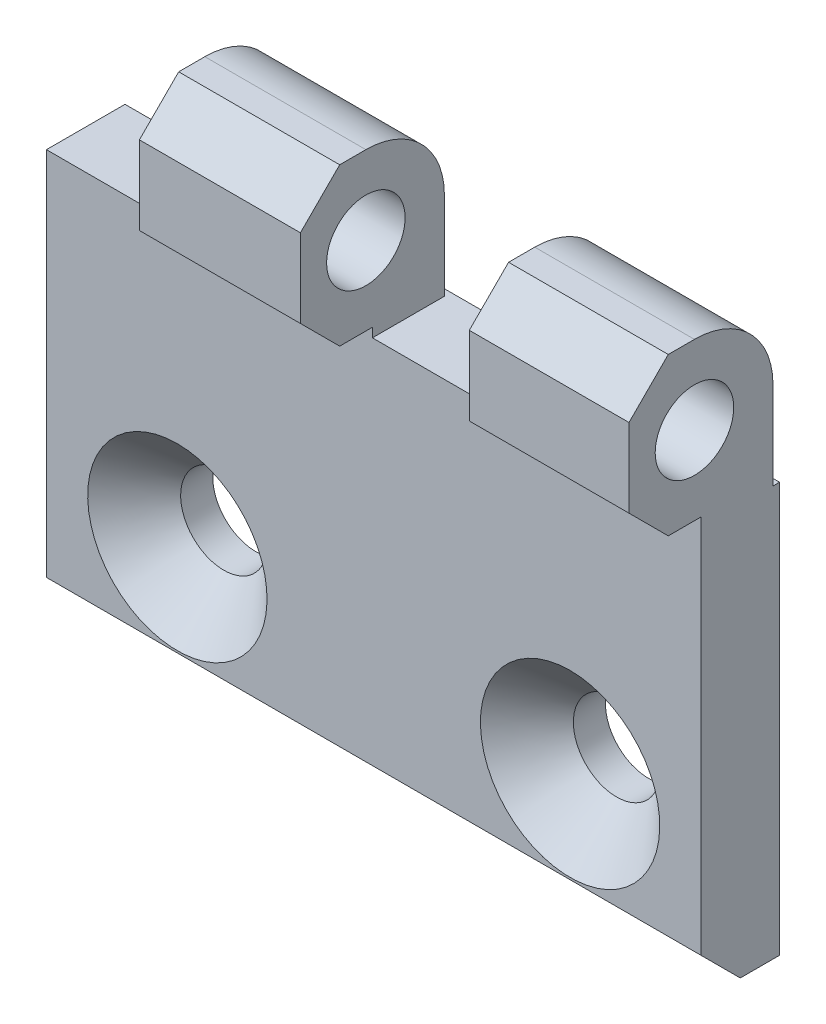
ISO-10303-21;
HEADER;
FILE_DESCRIPTION(('STEP AP214'),'2;1');
FILE_NAME('part.step','',(''),(''),'','','');
FILE_SCHEMA(('AUTOMOTIVE_DESIGN { 1 0 10303 214 1 1 1 1 }'));
ENDSEC;
DATA;
#1=APPLICATION_CONTEXT('core data for automotive mechanical design processes');
#2=APPLICATION_PROTOCOL_DEFINITION('international standard','automotive_design',2000,#1);
#3=PRODUCT_CONTEXT('',#1,'mechanical');
#4=PRODUCT('Part','Part','',(#3));
#5=PRODUCT_RELATED_PRODUCT_CATEGORY('part','',(#4));
#6=PRODUCT_DEFINITION_FORMATION('','',#4);
#7=PRODUCT_DEFINITION_CONTEXT('part definition',#1,'design');
#8=PRODUCT_DEFINITION('design','',#6,#7);
#9=PRODUCT_DEFINITION_SHAPE('','',#8);
#10=(LENGTH_UNIT() NAMED_UNIT(*) SI_UNIT(.MILLI.,.METRE.));
#11=(NAMED_UNIT(*) PLANE_ANGLE_UNIT() SI_UNIT($,.RADIAN.));
#12=(NAMED_UNIT(*) SI_UNIT($,.STERADIAN.) SOLID_ANGLE_UNIT());
#13=UNCERTAINTY_MEASURE_WITH_UNIT(LENGTH_MEASURE(1.E-05),#10,'distance_accuracy_value','');
#14=(GEOMETRIC_REPRESENTATION_CONTEXT(3) GLOBAL_UNCERTAINTY_ASSIGNED_CONTEXT((#13)) GLOBAL_UNIT_ASSIGNED_CONTEXT((#10,
#11,#12)) REPRESENTATION_CONTEXT('',''));
#15=CARTESIAN_POINT('',(0.,0.,0.));
#16=DIRECTION('',(0.,0.,1.));
#17=DIRECTION('',(1.,0.,0.));
#18=AXIS2_PLACEMENT_3D('',#15,#16,#17);
#19=CARTESIAN_POINT('',(40.,21.3,3.));
#20=DIRECTION('',(0.,0.,-1.));
#21=DIRECTION('',(1.,0.,0.));
#22=AXIS2_PLACEMENT_3D('',#19,#20,#21);
#23=PLANE('',#22);
#24=DIRECTION('',(-1.,0.,0.));
#25=VECTOR('',#24,1.);
#26=CARTESIAN_POINT('',(-4.818,18.,3.));
#27=LINE('',#26,#25);
#28=CARTESIAN_POINT('',(-4.818,18.,3.));
#29=VERTEX_POINT('',#28);
#30=CARTESIAN_POINT('',(35.182,18.,3.));
#31=VERTEX_POINT('',#30);
#32=EDGE_CURVE('E301',#29,#31,#27,.F.);
#33=ORIENTED_EDGE('',*,*,#32,.T.);
#34=DIRECTION('',(0.,1.,0.));
#35=VECTOR('',#34,1.);
#36=CARTESIAN_POINT('',(35.182,18.,3.));
#37=LINE('',#36,#35);
#38=CARTESIAN_POINT('',(35.182,7.,3.));
#39=VERTEX_POINT('',#38);
#40=EDGE_CURVE('E261',#31,#39,#37,.F.);
#41=ORIENTED_EDGE('',*,*,#40,.T.);
#42=DIRECTION('',(1.,0.,0.));
#43=VECTOR('',#42,1.);
#44=CARTESIAN_POINT('',(35.182,7.,3.));
#45=LINE('',#44,#43);
#46=CARTESIAN_POINT('',(30.,7.,3.));
#47=VERTEX_POINT('',#46);
#48=EDGE_CURVE('E293',#39,#47,#45,.F.);
#49=ORIENTED_EDGE('',*,*,#48,.T.);
#50=CARTESIAN_POINT('',(30.,0.,3.));
#51=DIRECTION('',(0.,0.,-1.));
#52=DIRECTION('',(1.,0.,0.));
#53=AXIS2_PLACEMENT_3D('',#50,#51,#52);
#54=CIRCLE('',#53,7.);
#55=CARTESIAN_POINT('',(25.1010205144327,-4.9999999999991,3.));
#56=VERTEX_POINT('',#55);
#57=EDGE_CURVE('E216',#56,#47,#54,.T.);
#58=ORIENTED_EDGE('',*,*,#57,.F.);
#59=DIRECTION('',(1.,0.,0.));
#60=VECTOR('',#59,1.);
#61=CARTESIAN_POINT('',(25.10102051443,-5.,3.));
#62=LINE('',#61,#60);
#63=CARTESIAN_POINT('',(4.89897948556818,-5.,3.));
#64=VERTEX_POINT('',#63);
#65=EDGE_CURVE('E212',#56,#64,#62,.F.);
#66=ORIENTED_EDGE('',*,*,#65,.T.);
#67=CARTESIAN_POINT('',(0.,0.,3.));
#68=DIRECTION('',(0.,0.,-1.));
#69=DIRECTION('',(1.,0.,0.));
#70=AXIS2_PLACEMENT_3D('',#67,#68,#69);
#71=CIRCLE('',#70,7.);
#72=CARTESIAN_POINT('',(0.,7.,3.));
#73=VERTEX_POINT('',#72);
#74=EDGE_CURVE('E17',#73,#64,#71,.T.);
#75=ORIENTED_EDGE('',*,*,#74,.F.);
#76=DIRECTION('',(1.,0.,0.));
#77=VECTOR('',#76,1.);
#78=CARTESIAN_POINT('',(0.,7.,3.));
#79=LINE('',#78,#77);
#80=CARTESIAN_POINT('',(-4.818,7.,3.));
#81=VERTEX_POINT('',#80);
#82=EDGE_CURVE('E207',#73,#81,#79,.F.);
#83=ORIENTED_EDGE('',*,*,#82,.T.);
#84=DIRECTION('',(0.,-1.,0.));
#85=VECTOR('',#84,1.);
#86=CARTESIAN_POINT('',(-4.818,7.,3.));
#87=LINE('',#86,#85);
#88=EDGE_CURVE('E250',#81,#29,#87,.F.);
#89=ORIENTED_EDGE('',*,*,#88,.T.);
#90=EDGE_LOOP('',(#33,#41,#49,#58,#66,#75,#83,#89));
#91=FACE_BOUND('',#90,.T.);
#92=ADVANCED_FACE('F14',(#91),#23,.T.);
#93=CARTESIAN_POINT('',(-4.818,18.,0.));
#94=DIRECTION('',(0.,1.,0.));
#95=DIRECTION('',(-1.,0.,0.));
#96=AXIS2_PLACEMENT_3D('',#93,#94,#95);
#97=PLANE('',#96);
#98=ORIENTED_EDGE('',*,*,#32,.F.);
#99=DIRECTION('',(0.,0.,1.));
#100=VECTOR('',#99,1.);
#101=CARTESIAN_POINT('',(-4.818,18.,0.));
#102=LINE('',#101,#100);
#103=CARTESIAN_POINT('',(-4.818,18.,0.));
#104=VERTEX_POINT('',#103);
#105=EDGE_CURVE('E248',#29,#104,#102,.F.);
#106=ORIENTED_EDGE('',*,*,#105,.T.);
#107=DIRECTION('',(1.,0.,0.));
#108=VECTOR('',#107,1.);
#109=CARTESIAN_POINT('',(40.,18.,0.));
#110=LINE('',#109,#108);
#111=CARTESIAN_POINT('',(35.182,18.,0.));
#112=VERTEX_POINT('',#111);
#113=EDGE_CURVE('E245',#112,#104,#110,.F.);
#114=ORIENTED_EDGE('',*,*,#113,.F.);
#115=DIRECTION('',(0.,0.,1.));
#116=VECTOR('',#115,1.);
#117=CARTESIAN_POINT('',(35.182,18.,0.));
#118=LINE('',#117,#116);
#119=EDGE_CURVE('E258',#112,#31,#118,.T.);
#120=ORIENTED_EDGE('',*,*,#119,.T.);
#121=EDGE_LOOP('',(#98,#106,#114,#120));
#122=FACE_BOUND('',#121,.T.);
#123=ADVANCED_FACE('F774',(#122),#97,.F.);
#124=CARTESIAN_POINT('',(-4.818,7.,0.));
#125=DIRECTION('',(-1.,0.,0.));
#126=DIRECTION('',(0.,-1.,0.));
#127=AXIS2_PLACEMENT_3D('',#124,#125,#126);
#128=PLANE('',#127);
#129=ORIENTED_EDGE('',*,*,#88,.F.);
#130=DIRECTION('',(0.,0.,1.));
#131=VECTOR('',#130,1.);
#132=CARTESIAN_POINT('',(-4.818,7.,0.));
#133=LINE('',#132,#131);
#134=CARTESIAN_POINT('',(-4.818,7.,0.));
#135=VERTEX_POINT('',#134);
#136=EDGE_CURVE('E237',#81,#135,#133,.F.);
#137=ORIENTED_EDGE('',*,*,#136,.T.);
#138=DIRECTION('',(0.,-1.,0.));
#139=VECTOR('',#138,1.);
#140=CARTESIAN_POINT('',(-4.818,21.3,0.));
#141=LINE('',#140,#139);
#142=EDGE_CURVE('E241',#104,#135,#141,.T.);
#143=ORIENTED_EDGE('',*,*,#142,.F.);
#144=ORIENTED_EDGE('',*,*,#105,.F.);
#145=EDGE_LOOP('',(#129,#137,#143,#144));
#146=FACE_BOUND('',#145,.T.);
#147=ADVANCED_FACE('F772',(#146),#128,.F.);
#148=CARTESIAN_POINT('',(0.,7.,0.));
#149=DIRECTION('',(0.,-1.,0.));
#150=DIRECTION('',(1.,0.,0.));
#151=AXIS2_PLACEMENT_3D('',#148,#149,#150);
#152=PLANE('',#151);
#153=ORIENTED_EDGE('',*,*,#82,.F.);
#154=DIRECTION('',(0.,0.,-1.));
#155=VECTOR('',#154,1.);
#156=CARTESIAN_POINT('',(0.,7.,0.));
#157=LINE('',#156,#155);
#158=CARTESIAN_POINT('',(0.,7.,0.));
#159=VERTEX_POINT('',#158);
#160=EDGE_CURVE('E226',#159,#73,#157,.F.);
#161=ORIENTED_EDGE('',*,*,#160,.F.);
#162=DIRECTION('',(1.,0.,0.));
#163=VECTOR('',#162,1.);
#164=CARTESIAN_POINT('',(40.,7.,0.));
#165=LINE('',#164,#163);
#166=EDGE_CURVE('E244',#135,#159,#165,.T.);
#167=ORIENTED_EDGE('',*,*,#166,.F.);
#168=ORIENTED_EDGE('',*,*,#136,.F.);
#169=EDGE_LOOP('',(#153,#161,#167,#168));
#170=FACE_BOUND('',#169,.T.);
#171=ADVANCED_FACE('F769',(#170),#152,.F.);
#172=CARTESIAN_POINT('',(0.,0.,0.));
#173=DIRECTION('',(0.,0.,-1.));
#174=DIRECTION('',(1.,0.,0.));
#175=AXIS2_PLACEMENT_3D('',#172,#173,#174);
#176=CYLINDRICAL_SURFACE('',#175,7.);
#177=DIRECTION('',(0.,0.,1.));
#178=VECTOR('',#177,1.);
#179=CARTESIAN_POINT('',(4.89897948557,-5.,0.));
#180=LINE('',#179,#178);
#181=CARTESIAN_POINT('',(4.89897948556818,-5.,0.));
#182=VERTEX_POINT('',#181);
#183=EDGE_CURVE('E220',#64,#182,#180,.F.);
#184=ORIENTED_EDGE('',*,*,#183,.T.);
#185=CARTESIAN_POINT('',(0.,0.,0.));
#186=DIRECTION('',(0.,0.,-1.));
#187=DIRECTION('',(1.,0.,0.));
#188=AXIS2_PLACEMENT_3D('',#185,#186,#187);
#189=CIRCLE('',#188,7.);
#190=EDGE_CURVE('E338',#159,#182,#189,.T.);
#191=ORIENTED_EDGE('',*,*,#190,.F.);
#192=ORIENTED_EDGE('',*,*,#160,.T.);
#193=ORIENTED_EDGE('',*,*,#74,.T.);
#194=EDGE_LOOP('',(#184,#191,#192,#193));
#195=FACE_BOUND('',#194,.T.);
#196=ADVANCED_FACE('F223',(#195),#176,.T.);
#197=CARTESIAN_POINT('',(25.10102051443,-5.,0.));
#198=DIRECTION('',(0.,-1.,0.));
#199=DIRECTION('',(1.,0.,0.));
#200=AXIS2_PLACEMENT_3D('',#197,#198,#199);
#201=PLANE('',#200);
#202=ORIENTED_EDGE('',*,*,#65,.F.);
#203=DIRECTION('',(0.,0.,-1.));
#204=VECTOR('',#203,1.);
#205=CARTESIAN_POINT('',(25.1010205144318,-4.99999999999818,0.));
#206=LINE('',#205,#204);
#207=CARTESIAN_POINT('',(25.1010205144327,-4.9999999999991,0.));
#208=VERTEX_POINT('',#207);
#209=EDGE_CURVE('E231',#208,#56,#206,.F.);
#210=ORIENTED_EDGE('',*,*,#209,.F.);
#211=DIRECTION('',(1.,0.,0.));
#212=VECTOR('',#211,1.);
#213=CARTESIAN_POINT('',(40.,-5.,0.));
#214=LINE('',#213,#212);
#215=EDGE_CURVE('E229',#182,#208,#214,.T.);
#216=ORIENTED_EDGE('',*,*,#215,.F.);
#217=ORIENTED_EDGE('',*,*,#183,.F.);
#218=EDGE_LOOP('',(#202,#210,#216,#217));
#219=FACE_BOUND('',#218,.T.);
#220=ADVANCED_FACE('F227',(#219),#201,.F.);
#221=CARTESIAN_POINT('',(30.,0.,0.));
#222=DIRECTION('',(0.,0.,-1.));
#223=DIRECTION('',(1.,0.,0.));
#224=AXIS2_PLACEMENT_3D('',#221,#222,#223);
#225=CYLINDRICAL_SURFACE('',#224,7.);
#226=DIRECTION('',(0.,0.,1.));
#227=VECTOR('',#226,1.);
#228=CARTESIAN_POINT('',(30.,7.,0.));
#229=LINE('',#228,#227);
#230=CARTESIAN_POINT('',(30.,7.,0.));
#231=VERTEX_POINT('',#230);
#232=EDGE_CURVE('E262',#47,#231,#229,.F.);
#233=ORIENTED_EDGE('',*,*,#232,.T.);
#234=CARTESIAN_POINT('',(30.,0.,0.));
#235=DIRECTION('',(0.,0.,-1.));
#236=DIRECTION('',(1.,0.,0.));
#237=AXIS2_PLACEMENT_3D('',#234,#235,#236);
#238=CIRCLE('',#237,7.);
#239=EDGE_CURVE('E334',#208,#231,#238,.T.);
#240=ORIENTED_EDGE('',*,*,#239,.F.);
#241=ORIENTED_EDGE('',*,*,#209,.T.);
#242=ORIENTED_EDGE('',*,*,#57,.T.);
#243=EDGE_LOOP('',(#233,#240,#241,#242));
#244=FACE_BOUND('',#243,.T.);
#245=ADVANCED_FACE('F345',(#244),#225,.T.);
#246=CARTESIAN_POINT('',(35.182,7.,0.));
#247=DIRECTION('',(0.,-1.,0.));
#248=DIRECTION('',(1.,0.,0.));
#249=AXIS2_PLACEMENT_3D('',#246,#247,#248);
#250=PLANE('',#249);
#251=ORIENTED_EDGE('',*,*,#48,.F.);
#252=DIRECTION('',(0.,0.,1.));
#253=VECTOR('',#252,1.);
#254=CARTESIAN_POINT('',(35.182,7.,0.));
#255=LINE('',#254,#253);
#256=CARTESIAN_POINT('',(35.182,7.,0.));
#257=VERTEX_POINT('',#256);
#258=EDGE_CURVE('E298',#39,#257,#255,.F.);
#259=ORIENTED_EDGE('',*,*,#258,.T.);
#260=DIRECTION('',(1.,0.,0.));
#261=VECTOR('',#260,1.);
#262=CARTESIAN_POINT('',(40.,7.,0.));
#263=LINE('',#262,#261);
#264=EDGE_CURVE('E337',#231,#257,#263,.T.);
#265=ORIENTED_EDGE('',*,*,#264,.F.);
#266=ORIENTED_EDGE('',*,*,#232,.F.);
#267=EDGE_LOOP('',(#251,#259,#265,#266));
#268=FACE_BOUND('',#267,.T.);
#269=ADVANCED_FACE('F350',(#268),#250,.F.);
#270=CARTESIAN_POINT('',(35.182,18.,0.));
#271=DIRECTION('',(1.,0.,0.));
#272=DIRECTION('',(0.,1.,0.));
#273=AXIS2_PLACEMENT_3D('',#270,#271,#272);
#274=PLANE('',#273);
#275=ORIENTED_EDGE('',*,*,#40,.F.);
#276=ORIENTED_EDGE('',*,*,#119,.F.);
#277=DIRECTION('',(0.,-1.,0.));
#278=VECTOR('',#277,1.);
#279=CARTESIAN_POINT('',(35.182,21.3,0.));
#280=LINE('',#279,#278);
#281=EDGE_CURVE('E358',#257,#112,#280,.F.);
#282=ORIENTED_EDGE('',*,*,#281,.F.);
#283=ORIENTED_EDGE('',*,*,#258,.F.);
#284=EDGE_LOOP('',(#275,#276,#282,#283));
#285=FACE_BOUND('',#284,.T.);
#286=ADVANCED_FACE('F757',(#285),#274,.F.);
#287=CARTESIAN_POINT('',(14.9,22.,11.5));
#288=DIRECTION('',(0.,0.,1.));
#289=DIRECTION('',(-1.,0.,0.));
#290=AXIS2_PLACEMENT_3D('',#287,#288,#289);
#291=PLANE('',#290);
#292=DIRECTION('',(-1.,0.,0.));
#293=VECTOR('',#292,1.);
#294=CARTESIAN_POINT('',(14.9,25.,11.5));
#295=LINE('',#294,#293);
#296=CARTESIAN_POINT('',(14.9,25.,11.5));
#297=VERTEX_POINT('',#296);
#298=CARTESIAN_POINT('',(2.6,25.,11.5));
#299=VERTEX_POINT('',#298);
#300=EDGE_CURVE('E342',#297,#299,#295,.T.);
#301=ORIENTED_EDGE('',*,*,#300,.F.);
#302=DIRECTION('',(0.,-1.,0.));
#303=VECTOR('',#302,1.);
#304=CARTESIAN_POINT('',(14.9,5.65,11.5));
#305=LINE('',#304,#303);
#306=CARTESIAN_POINT('',(14.9,31.,11.5));
#307=VERTEX_POINT('',#306);
#308=EDGE_CURVE('E381',#297,#307,#305,.F.);
#309=ORIENTED_EDGE('',*,*,#308,.T.);
#310=DIRECTION('',(-1.,0.,0.));
#311=VECTOR('',#310,1.);
#312=CARTESIAN_POINT('',(14.9,31.,11.5));
#313=LINE('',#312,#311);
#314=CARTESIAN_POINT('',(2.6,31.,11.5));
#315=VERTEX_POINT('',#314);
#316=EDGE_CURVE('E363',#315,#307,#313,.F.);
#317=ORIENTED_EDGE('',*,*,#316,.F.);
#318=DIRECTION('',(0.,-1.,0.));
#319=VECTOR('',#318,1.);
#320=CARTESIAN_POINT('',(2.6,5.65,11.5));
#321=LINE('',#320,#319);
#322=EDGE_CURVE('E422',#299,#315,#321,.F.);
#323=ORIENTED_EDGE('',*,*,#322,.F.);
#324=EDGE_LOOP('',(#301,#309,#317,#323));
#325=FACE_BOUND('',#324,.T.);
#326=ADVANCED_FACE('F612',(#325),#291,.T.);
#327=CARTESIAN_POINT('',(14.9,34.,8.5));
#328=DIRECTION('',(0.,0.707106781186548,0.707106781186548));
#329=DIRECTION('',(0.,0.707106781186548,-0.707106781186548));
#330=AXIS2_PLACEMENT_3D('',#327,#328,#329);
#331=PLANE('',#330);
#332=DIRECTION('',(0.,0.707106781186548,-0.707106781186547));
#333=VECTOR('',#332,1.);
#334=CARTESIAN_POINT('',(14.9,31.,11.5));
#335=LINE('',#334,#333);
#336=CARTESIAN_POINT('',(14.9,34.,8.5));
#337=VERTEX_POINT('',#336);
#338=EDGE_CURVE('E383',#307,#337,#335,.T.);
#339=ORIENTED_EDGE('',*,*,#338,.T.);
#340=DIRECTION('',(-1.,0.,0.));
#341=VECTOR('',#340,1.);
#342=CARTESIAN_POINT('',(14.9,34.,8.5));
#343=LINE('',#342,#341);
#344=CARTESIAN_POINT('',(2.6,34.,8.5));
#345=VERTEX_POINT('',#344);
#346=EDGE_CURVE('E367',#345,#337,#343,.F.);
#347=ORIENTED_EDGE('',*,*,#346,.F.);
#348=DIRECTION('',(0.,0.707106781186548,-0.707106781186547));
#349=VECTOR('',#348,1.);
#350=CARTESIAN_POINT('',(2.6,31.,11.5));
#351=LINE('',#350,#349);
#352=EDGE_CURVE('E419',#315,#345,#351,.T.);
#353=ORIENTED_EDGE('',*,*,#352,.F.);
#354=ORIENTED_EDGE('',*,*,#316,.T.);
#355=EDGE_LOOP('',(#339,#347,#353,#354));
#356=FACE_BOUND('',#355,.T.);
#357=ADVANCED_FACE('F588',(#356),#331,.T.);
#358=CARTESIAN_POINT('',(14.9,34.,11.5));
#359=DIRECTION('',(0.,1.,0.));
#360=DIRECTION('',(-1.,0.,0.));
#361=AXIS2_PLACEMENT_3D('',#358,#359,#360);
#362=PLANE('',#361);
#363=ORIENTED_EDGE('',*,*,#346,.T.);
#364=DIRECTION('',(0.,0.,1.));
#365=VECTOR('',#364,1.);
#366=CARTESIAN_POINT('',(14.9,34.,0.));
#367=LINE('',#366,#365);
#368=CARTESIAN_POINT('',(14.9,34.,6.5));
#369=VERTEX_POINT('',#368);
#370=EDGE_CURVE('E329',#337,#369,#367,.F.);
#371=ORIENTED_EDGE('',*,*,#370,.T.);
#372=DIRECTION('',(-1.,0.,0.));
#373=VECTOR('',#372,1.);
#374=CARTESIAN_POINT('',(14.9,34.,6.5));
#375=LINE('',#374,#373);
#376=CARTESIAN_POINT('',(2.6,34.,6.5));
#377=VERTEX_POINT('',#376);
#378=EDGE_CURVE('E373',#377,#369,#375,.F.);
#379=ORIENTED_EDGE('',*,*,#378,.F.);
#380=DIRECTION('',(0.,0.,1.));
#381=VECTOR('',#380,1.);
#382=CARTESIAN_POINT('',(2.6,34.,0.));
#383=LINE('',#382,#381);
#384=EDGE_CURVE('E333',#345,#377,#383,.F.);
#385=ORIENTED_EDGE('',*,*,#384,.F.);
#386=EDGE_LOOP('',(#363,#371,#379,#385));
#387=FACE_BOUND('',#386,.T.);
#388=ADVANCED_FACE('F594',(#387),#362,.T.);
#389=CARTESIAN_POINT('',(14.9,28.,6.5));
#390=DIRECTION('',(-1.,0.,0.));
#391=DIRECTION('',(0.,-1.,0.));
#392=AXIS2_PLACEMENT_3D('',#389,#390,#391);
#393=CYLINDRICAL_SURFACE('',#392,6.);
#394=ORIENTED_EDGE('',*,*,#378,.T.);
#395=CARTESIAN_POINT('',(14.9,28.,6.5));
#396=DIRECTION('',(-1.,0.,0.));
#397=DIRECTION('',(0.,-1.,0.));
#398=AXIS2_PLACEMENT_3D('',#395,#396,#397);
#399=CIRCLE('',#398,6.);
#400=CARTESIAN_POINT('',(14.9,28.,0.5));
#401=VERTEX_POINT('',#400);
#402=EDGE_CURVE('E327',#369,#401,#399,.T.);
#403=ORIENTED_EDGE('',*,*,#402,.T.);
#404=DIRECTION('',(1.,0.,0.));
#405=VECTOR('',#404,1.);
#406=CARTESIAN_POINT('',(14.9,28.,0.5));
#407=LINE('',#406,#405);
#408=CARTESIAN_POINT('',(2.6,28.,0.5));
#409=VERTEX_POINT('',#408);
#410=EDGE_CURVE('E409',#409,#401,#407,.T.);
#411=ORIENTED_EDGE('',*,*,#410,.F.);
#412=CARTESIAN_POINT('',(2.6,28.,6.5));
#413=DIRECTION('',(-1.,0.,0.));
#414=DIRECTION('',(0.,-1.,0.));
#415=AXIS2_PLACEMENT_3D('',#412,#413,#414);
#416=CIRCLE('',#415,6.);
#417=EDGE_CURVE('E330',#377,#409,#416,.T.);
#418=ORIENTED_EDGE('',*,*,#417,.F.);
#419=EDGE_LOOP('',(#394,#403,#411,#418));
#420=FACE_BOUND('',#419,.T.);
#421=ADVANCED_FACE('F602',(#420),#393,.T.);
#422=CARTESIAN_POINT('',(27.8,34.,11.5));
#423=DIRECTION('',(0.,0.,1.));
#424=DIRECTION('',(-1.,0.,0.));
#425=AXIS2_PLACEMENT_3D('',#422,#423,#424);
#426=PLANE('',#425);
#427=DIRECTION('',(-1.,0.,0.));
#428=VECTOR('',#427,1.);
#429=CARTESIAN_POINT('',(27.8,31.,11.5));
#430=LINE('',#429,#428);
#431=CARTESIAN_POINT('',(27.8,31.,11.5));
#432=VERTEX_POINT('',#431);
#433=CARTESIAN_POINT('',(40.,31.,11.5));
#434=VERTEX_POINT('',#433);
#435=EDGE_CURVE('E545',#432,#434,#430,.F.);
#436=ORIENTED_EDGE('',*,*,#435,.F.);
#437=DIRECTION('',(0.,1.,0.));
#438=VECTOR('',#437,1.);
#439=CARTESIAN_POINT('',(27.8,5.65,11.5));
#440=LINE('',#439,#438);
#441=CARTESIAN_POINT('',(27.8,25.,11.5));
#442=VERTEX_POINT('',#441);
#443=EDGE_CURVE('E282',#432,#442,#440,.F.);
#444=ORIENTED_EDGE('',*,*,#443,.T.);
#445=DIRECTION('',(-1.,0.,0.));
#446=VECTOR('',#445,1.);
#447=CARTESIAN_POINT('',(27.8,25.,11.5));
#448=LINE('',#447,#446);
#449=CARTESIAN_POINT('',(40.,25.,11.5));
#450=VERTEX_POINT('',#449);
#451=EDGE_CURVE('E393',#450,#442,#448,.T.);
#452=ORIENTED_EDGE('',*,*,#451,.F.);
#453=DIRECTION('',(0.,-1.,0.));
#454=VECTOR('',#453,1.);
#455=CARTESIAN_POINT('',(40.,5.65,11.5));
#456=LINE('',#455,#454);
#457=EDGE_CURVE('E549',#450,#434,#456,.F.);
#458=ORIENTED_EDGE('',*,*,#457,.T.);
#459=EDGE_LOOP('',(#436,#444,#452,#458));
#460=FACE_BOUND('',#459,.T.);
#461=ADVANCED_FACE('F722',(#460),#426,.T.);
#462=CARTESIAN_POINT('',(27.8,31.,11.5));
#463=DIRECTION('',(0.,0.707106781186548,0.707106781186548));
#464=DIRECTION('',(0.,0.707106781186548,-0.707106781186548));
#465=AXIS2_PLACEMENT_3D('',#462,#463,#464);
#466=PLANE('',#465);
#467=DIRECTION('',(0.,-0.707106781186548,0.707106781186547));
#468=VECTOR('',#467,1.);
#469=CARTESIAN_POINT('',(27.8,34.,8.5));
#470=LINE('',#469,#468);
#471=CARTESIAN_POINT('',(27.8,34.,8.5));
#472=VERTEX_POINT('',#471);
#473=EDGE_CURVE('E279',#472,#432,#470,.T.);
#474=ORIENTED_EDGE('',*,*,#473,.T.);
#475=ORIENTED_EDGE('',*,*,#435,.T.);
#476=DIRECTION('',(0.,0.707106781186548,-0.707106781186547));
#477=VECTOR('',#476,1.);
#478=CARTESIAN_POINT('',(40.,31.,11.5));
#479=LINE('',#478,#477);
#480=CARTESIAN_POINT('',(40.,34.,8.5));
#481=VERTEX_POINT('',#480);
#482=EDGE_CURVE('E483',#434,#481,#479,.T.);
#483=ORIENTED_EDGE('',*,*,#482,.T.);
#484=DIRECTION('',(-1.,0.,0.));
#485=VECTOR('',#484,1.);
#486=CARTESIAN_POINT('',(27.8,34.,8.5));
#487=LINE('',#486,#485);
#488=EDGE_CURVE('E542',#472,#481,#487,.F.);
#489=ORIENTED_EDGE('',*,*,#488,.F.);
#490=EDGE_LOOP('',(#474,#475,#483,#489));
#491=FACE_BOUND('',#490,.T.);
#492=ADVANCED_FACE('F719',(#491),#466,.T.);
#493=CARTESIAN_POINT('',(27.8,34.,6.5));
#494=DIRECTION('',(0.,1.,0.));
#495=DIRECTION('',(-1.,0.,0.));
#496=AXIS2_PLACEMENT_3D('',#493,#494,#495);
#497=PLANE('',#496);
#498=DIRECTION('',(1.,0.,0.));
#499=VECTOR('',#498,1.);
#500=CARTESIAN_POINT('',(27.8,34.,6.5));
#501=LINE('',#500,#499);
#502=CARTESIAN_POINT('',(27.8,34.,6.5));
#503=VERTEX_POINT('',#502);
#504=CARTESIAN_POINT('',(40.,34.,6.5));
#505=VERTEX_POINT('',#504);
#506=EDGE_CURVE('E539',#503,#505,#501,.T.);
#507=ORIENTED_EDGE('',*,*,#506,.F.);
#508=DIRECTION('',(0.,0.,1.));
#509=VECTOR('',#508,1.);
#510=CARTESIAN_POINT('',(27.8,34.,0.));
#511=LINE('',#510,#509);
#512=EDGE_CURVE('E283',#503,#472,#511,.T.);
#513=ORIENTED_EDGE('',*,*,#512,.T.);
#514=ORIENTED_EDGE('',*,*,#488,.T.);
#515=DIRECTION('',(0.,0.,1.));
#516=VECTOR('',#515,1.);
#517=CARTESIAN_POINT('',(40.,34.,0.));
#518=LINE('',#517,#516);
#519=EDGE_CURVE('E318',#481,#505,#518,.F.);
#520=ORIENTED_EDGE('',*,*,#519,.T.);
#521=EDGE_LOOP('',(#507,#513,#514,#520));
#522=FACE_BOUND('',#521,.T.);
#523=ADVANCED_FACE('F717',(#522),#497,.T.);
#524=CARTESIAN_POINT('',(27.8,28.,6.5));
#525=DIRECTION('',(1.,0.,0.));
#526=DIRECTION('',(0.,1.,0.));
#527=AXIS2_PLACEMENT_3D('',#524,#525,#526);
#528=CYLINDRICAL_SURFACE('',#527,6.);
#529=DIRECTION('',(1.,0.,0.));
#530=VECTOR('',#529,1.);
#531=CARTESIAN_POINT('',(27.8,28.,0.5));
#532=LINE('',#531,#530);
#533=CARTESIAN_POINT('',(27.8,28.,0.5));
#534=VERTEX_POINT('',#533);
#535=CARTESIAN_POINT('',(40.,28.,0.5));
#536=VERTEX_POINT('',#535);
#537=EDGE_CURVE('E268',#534,#536,#532,.T.);
#538=ORIENTED_EDGE('',*,*,#537,.F.);
#539=CARTESIAN_POINT('',(27.8,28.,6.5));
#540=DIRECTION('',(1.,0.,0.));
#541=DIRECTION('',(0.,1.,0.));
#542=AXIS2_PLACEMENT_3D('',#539,#540,#541);
#543=CIRCLE('',#542,6.);
#544=EDGE_CURVE('E340',#534,#503,#543,.T.);
#545=ORIENTED_EDGE('',*,*,#544,.T.);
#546=ORIENTED_EDGE('',*,*,#506,.T.);
#547=CARTESIAN_POINT('',(40.,28.,6.5));
#548=DIRECTION('',(1.,0.,0.));
#549=DIRECTION('',(0.,1.,0.));
#550=AXIS2_PLACEMENT_3D('',#547,#548,#549);
#551=CIRCLE('',#550,6.);
#552=EDGE_CURVE('E315',#505,#536,#551,.F.);
#553=ORIENTED_EDGE('',*,*,#552,.T.);
#554=EDGE_LOOP('',(#538,#545,#546,#553));
#555=FACE_BOUND('',#554,.T.);
#556=ADVANCED_FACE('F712',(#555),#528,.T.);
#557=CARTESIAN_POINT('',(40.,-10.,0.));
#558=DIRECTION('',(0.,-1.,0.));
#559=DIRECTION('',(1.,0.,0.));
#560=AXIS2_PLACEMENT_3D('',#557,#558,#559);
#561=PLANE('',#560);
#562=DIRECTION('',(1.,0.,0.));
#563=VECTOR('',#562,1.);
#564=CARTESIAN_POINT('',(40.,-10.,0.));
#565=LINE('',#564,#563);
#566=CARTESIAN_POINT('',(40.,-10.,0.));
#567=VERTEX_POINT('',#566);
#568=CARTESIAN_POINT('',(-10.,-10.,0.));
#569=VERTEX_POINT('',#568);
#570=EDGE_CURVE('E255',#567,#569,#565,.F.);
#571=ORIENTED_EDGE('',*,*,#570,.F.);
#572=DIRECTION('',(0.,0.,1.));
#573=VECTOR('',#572,1.);
#574=CARTESIAN_POINT('',(40.,-10.,0.));
#575=LINE('',#574,#573);
#576=CARTESIAN_POINT('',(40.,-10.,3.));
#577=VERTEX_POINT('',#576);
#578=EDGE_CURVE('E474',#567,#577,#575,.T.);
#579=ORIENTED_EDGE('',*,*,#578,.T.);
#580=DIRECTION('',(-1.,0.,0.));
#581=VECTOR('',#580,1.);
#582=CARTESIAN_POINT('',(40.,-10.,3.));
#583=LINE('',#582,#581);
#584=CARTESIAN_POINT('',(-10.,-10.,3.));
#585=VERTEX_POINT('',#584);
#586=EDGE_CURVE('E486',#585,#577,#583,.F.);
#587=ORIENTED_EDGE('',*,*,#586,.F.);
#588=DIRECTION('',(0.,0.,1.));
#589=VECTOR('',#588,1.);
#590=CARTESIAN_POINT('',(-10.,-10.,0.));
#591=LINE('',#590,#589);
#592=EDGE_CURVE('E493',#569,#585,#591,.T.);
#593=ORIENTED_EDGE('',*,*,#592,.F.);
#594=EDGE_LOOP('',(#571,#579,#587,#593));
#595=FACE_BOUND('',#594,.T.);
#596=ADVANCED_FACE('F629',(#595),#561,.T.);
#597=CARTESIAN_POINT('',(27.8,22.,8.5));
#598=DIRECTION('',(0.,-0.707106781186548,0.707106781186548));
#599=DIRECTION('',(0.,0.707106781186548,0.707106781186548));
#600=AXIS2_PLACEMENT_3D('',#597,#598,#599);
#601=PLANE('',#600);
#602=DIRECTION('',(0.,-0.707106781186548,-0.707106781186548));
#603=VECTOR('',#602,1.);
#604=CARTESIAN_POINT('',(27.8,25.,11.5));
#605=LINE('',#604,#603);
#606=CARTESIAN_POINT('',(27.8,22.,8.5));
#607=VERTEX_POINT('',#606);
#608=EDGE_CURVE('E287',#442,#607,#605,.T.);
#609=ORIENTED_EDGE('',*,*,#608,.T.);
#610=DIRECTION('',(1.,0.,0.));
#611=VECTOR('',#610,1.);
#612=CARTESIAN_POINT('',(27.8,22.,8.5));
#613=LINE('',#612,#611);
#614=CARTESIAN_POINT('',(40.,22.,8.5));
#615=VERTEX_POINT('',#614);
#616=EDGE_CURVE('E470',#615,#607,#613,.F.);
#617=ORIENTED_EDGE('',*,*,#616,.F.);
#618=DIRECTION('',(0.,0.707106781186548,0.707106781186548));
#619=VECTOR('',#618,1.);
#620=CARTESIAN_POINT('',(40.,22.,8.5));
#621=LINE('',#620,#619);
#622=EDGE_CURVE('E489',#615,#450,#621,.T.);
#623=ORIENTED_EDGE('',*,*,#622,.T.);
#624=ORIENTED_EDGE('',*,*,#451,.T.);
#625=EDGE_LOOP('',(#609,#617,#623,#624));
#626=FACE_BOUND('',#625,.T.);
#627=ADVANCED_FACE('F618',(#626),#601,.T.);
#628=CARTESIAN_POINT('',(14.9,25.,11.5));
#629=DIRECTION('',(0.,-0.707106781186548,0.707106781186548));
#630=DIRECTION('',(0.,0.707106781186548,0.707106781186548));
#631=AXIS2_PLACEMENT_3D('',#628,#629,#630);
#632=PLANE('',#631);
#633=DIRECTION('',(0.,0.707106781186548,0.707106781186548));
#634=VECTOR('',#633,1.);
#635=CARTESIAN_POINT('',(14.9,22.,8.5));
#636=LINE('',#635,#634);
#637=CARTESIAN_POINT('',(14.9,22.,8.5));
#638=VERTEX_POINT('',#637);
#639=EDGE_CURVE('E384',#638,#297,#636,.T.);
#640=ORIENTED_EDGE('',*,*,#639,.T.);
#641=ORIENTED_EDGE('',*,*,#300,.T.);
#642=DIRECTION('',(0.,0.707106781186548,0.707106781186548));
#643=VECTOR('',#642,1.);
#644=CARTESIAN_POINT('',(2.6,22.,8.5));
#645=LINE('',#644,#643);
#646=CARTESIAN_POINT('',(2.6,22.,8.5));
#647=VERTEX_POINT('',#646);
#648=EDGE_CURVE('E427',#647,#299,#645,.T.);
#649=ORIENTED_EDGE('',*,*,#648,.F.);
#650=DIRECTION('',(1.,0.,0.));
#651=VECTOR('',#650,1.);
#652=CARTESIAN_POINT('',(14.9,22.,8.5));
#653=LINE('',#652,#651);
#654=EDGE_CURVE('E396',#638,#647,#653,.F.);
#655=ORIENTED_EDGE('',*,*,#654,.F.);
#656=EDGE_LOOP('',(#640,#641,#649,#655));
#657=FACE_BOUND('',#656,.T.);
#658=ADVANCED_FACE('F615',(#657),#632,.T.);
#659=CARTESIAN_POINT('',(27.8,5.65,0.));
#660=DIRECTION('',(1.,0.,0.));
#661=DIRECTION('',(0.,1.,0.));
#662=AXIS2_PLACEMENT_3D('',#659,#660,#661);
#663=PLANE('',#662);
#664=DIRECTION('',(0.,0.,1.));
#665=VECTOR('',#664,1.);
#666=CARTESIAN_POINT('',(27.8,22.,11.5));
#667=LINE('',#666,#665);
#668=CARTESIAN_POINT('',(27.8,22.,6.));
#669=VERTEX_POINT('',#668);
#670=EDGE_CURVE('E400',#607,#669,#667,.F.);
#671=ORIENTED_EDGE('',*,*,#670,.F.);
#672=ORIENTED_EDGE('',*,*,#608,.F.);
#673=ORIENTED_EDGE('',*,*,#443,.F.);
#674=ORIENTED_EDGE('',*,*,#473,.F.);
#675=ORIENTED_EDGE('',*,*,#512,.F.);
#676=ORIENTED_EDGE('',*,*,#544,.F.);
#677=DIRECTION('',(0.,-1.,0.));
#678=VECTOR('',#677,1.);
#679=CARTESIAN_POINT('',(27.8,21.3,0.5));
#680=LINE('',#679,#678);
#681=CARTESIAN_POINT('',(27.8,21.3,0.5));
#682=VERTEX_POINT('',#681);
#683=EDGE_CURVE('E265',#682,#534,#680,.F.);
#684=ORIENTED_EDGE('',*,*,#683,.F.);
#685=DIRECTION('',(0.,0.,1.));
#686=VECTOR('',#685,1.);
#687=CARTESIAN_POINT('',(27.8,21.3,6.));
#688=LINE('',#687,#686);
#689=CARTESIAN_POINT('',(27.8,21.3,6.));
#690=VERTEX_POINT('',#689);
#691=EDGE_CURVE('E272',#690,#682,#688,.F.);
#692=ORIENTED_EDGE('',*,*,#691,.F.);
#693=DIRECTION('',(0.,1.,0.));
#694=VECTOR('',#693,1.);
#695=CARTESIAN_POINT('',(27.8,5.65,6.));
#696=LINE('',#695,#694);
#697=EDGE_CURVE('E269',#669,#690,#696,.F.);
#698=ORIENTED_EDGE('',*,*,#697,.F.);
#699=EDGE_LOOP('',(#671,#672,#673,#674,#675,#676,#684,#692,#698));
#700=FACE_BOUND('',#699,.T.);
#701=CARTESIAN_POINT('',(27.8,28.,6.5));
#702=DIRECTION('',(-1.,0.,0.));
#703=DIRECTION('',(0.,0.,1.));
#704=AXIS2_PLACEMENT_3D('',#701,#702,#703);
#705=CIRCLE('',#704,3.);
#706=CARTESIAN_POINT('',(27.8,28.,9.5));
#707=VERTEX_POINT('',#706);
#708=EDGE_CURVE('E1024',#707,#707,#705,.T.);
#709=ORIENTED_EDGE('',*,*,#708,.F.);
#710=EDGE_LOOP('',(#709));
#711=FACE_BOUND('',#710,.T.);
#712=ADVANCED_FACE('F617',(#700,#711),#663,.F.);
#713=CARTESIAN_POINT('',(27.8,21.3,0.5));
#714=DIRECTION('',(0.,0.,-1.));
#715=DIRECTION('',(1.,0.,0.));
#716=AXIS2_PLACEMENT_3D('',#713,#714,#715);
#717=PLANE('',#716);
#718=DIRECTION('',(0.,-1.,0.));
#719=VECTOR('',#718,1.);
#720=CARTESIAN_POINT('',(40.,5.65,0.5));
#721=LINE('',#720,#719);
#722=CARTESIAN_POINT('',(40.,21.3,0.5));
#723=VERTEX_POINT('',#722);
#724=EDGE_CURVE('E317',#536,#723,#721,.T.);
#725=ORIENTED_EDGE('',*,*,#724,.T.);
#726=DIRECTION('',(-1.,0.,0.));
#727=VECTOR('',#726,1.);
#728=CARTESIAN_POINT('',(40.,21.3,0.5));
#729=LINE('',#728,#727);
#730=EDGE_CURVE('E275',#682,#723,#729,.F.);
#731=ORIENTED_EDGE('',*,*,#730,.F.);
#732=ORIENTED_EDGE('',*,*,#683,.T.);
#733=ORIENTED_EDGE('',*,*,#537,.T.);
#734=EDGE_LOOP('',(#725,#731,#732,#733));
#735=FACE_BOUND('',#734,.T.);
#736=ADVANCED_FACE('F626',(#735),#717,.T.);
#737=CARTESIAN_POINT('',(40.,21.3,0.));
#738=DIRECTION('',(0.,0.,-1.));
#739=DIRECTION('',(1.,0.,0.));
#740=AXIS2_PLACEMENT_3D('',#737,#738,#739);
#741=PLANE('',#740);
#742=CARTESIAN_POINT('',(0.,0.,0.));
#743=DIRECTION('',(0.,0.,-1.));
#744=DIRECTION('',(1.,0.,0.));
#745=AXIS2_PLACEMENT_3D('',#742,#743,#744);
#746=CIRCLE('',#745,3.3);
#747=CARTESIAN_POINT('',(3.3,0.,0.));
#748=VERTEX_POINT('',#747);
#749=EDGE_CURVE('E323',#748,#748,#746,.F.);
#750=ORIENTED_EDGE('',*,*,#749,.T.);
#751=EDGE_LOOP('',(#750));
#752=FACE_BOUND('',#751,.T.);
#753=CARTESIAN_POINT('',(30.,0.,0.));
#754=DIRECTION('',(0.,0.,-1.));
#755=DIRECTION('',(1.,0.,0.));
#756=AXIS2_PLACEMENT_3D('',#753,#754,#755);
#757=CIRCLE('',#756,3.3);
#758=CARTESIAN_POINT('',(33.3,0.,0.));
#759=VERTEX_POINT('',#758);
#760=EDGE_CURVE('E319',#759,#759,#757,.F.);
#761=ORIENTED_EDGE('',*,*,#760,.T.);
#762=EDGE_LOOP('',(#761));
#763=FACE_BOUND('',#762,.T.);
#764=ORIENTED_EDGE('',*,*,#264,.T.);
#765=ORIENTED_EDGE('',*,*,#281,.T.);
#766=ORIENTED_EDGE('',*,*,#113,.T.);
#767=ORIENTED_EDGE('',*,*,#142,.T.);
#768=ORIENTED_EDGE('',*,*,#166,.T.);
#769=ORIENTED_EDGE('',*,*,#190,.T.);
#770=ORIENTED_EDGE('',*,*,#215,.T.);
#771=ORIENTED_EDGE('',*,*,#239,.T.);
#772=EDGE_LOOP('',(#764,#765,#766,#767,#768,#769,#770,#771));
#773=FACE_BOUND('',#772,.T.);
#774=DIRECTION('',(-1.,0.,0.));
#775=VECTOR('',#774,1.);
#776=CARTESIAN_POINT('',(40.,21.3,0.));
#777=LINE('',#776,#775);
#778=CARTESIAN_POINT('',(40.,21.3,0.));
#779=VERTEX_POINT('',#778);
#780=CARTESIAN_POINT('',(-10.,21.3,0.));
#781=VERTEX_POINT('',#780);
#782=EDGE_CURVE('E464',#779,#781,#777,.T.);
#783=ORIENTED_EDGE('',*,*,#782,.F.);
#784=DIRECTION('',(0.,-1.,0.));
#785=VECTOR('',#784,1.);
#786=CARTESIAN_POINT('',(40.,5.65,0.));
#787=LINE('',#786,#785);
#788=EDGE_CURVE('E476',#779,#567,#787,.T.);
#789=ORIENTED_EDGE('',*,*,#788,.T.);
#790=ORIENTED_EDGE('',*,*,#570,.T.);
#791=DIRECTION('',(0.,-1.,0.));
#792=VECTOR('',#791,1.);
#793=CARTESIAN_POINT('',(-10.,5.65,0.));
#794=LINE('',#793,#792);
#795=EDGE_CURVE('E322',#781,#569,#794,.T.);
#796=ORIENTED_EDGE('',*,*,#795,.F.);
#797=EDGE_LOOP('',(#783,#789,#790,#796));
#798=FACE_BOUND('',#797,.T.);
#799=ADVANCED_FACE('F688',(#752,#763,#773,#798),#741,.T.);
#800=CARTESIAN_POINT('',(2.6,5.65,0.));
#801=DIRECTION('',(-1.,0.,0.));
#802=DIRECTION('',(0.,-1.,0.));
#803=AXIS2_PLACEMENT_3D('',#800,#801,#802);
#804=PLANE('',#803);
#805=DIRECTION('',(0.,-1.,0.));
#806=VECTOR('',#805,1.);
#807=CARTESIAN_POINT('',(2.6,28.,0.5));
#808=LINE('',#807,#806);
#809=CARTESIAN_POINT('',(2.6,21.3,0.5));
#810=VERTEX_POINT('',#809);
#811=EDGE_CURVE('E332',#810,#409,#808,.F.);
#812=ORIENTED_EDGE('',*,*,#811,.F.);
#813=DIRECTION('',(0.,0.,1.));
#814=VECTOR('',#813,1.);
#815=CARTESIAN_POINT('',(2.6,21.3,6.));
#816=LINE('',#815,#814);
#817=CARTESIAN_POINT('',(2.6,21.3,6.));
#818=VERTEX_POINT('',#817);
#819=EDGE_CURVE('E412',#818,#810,#816,.F.);
#820=ORIENTED_EDGE('',*,*,#819,.F.);
#821=DIRECTION('',(0.,-1.,0.));
#822=VECTOR('',#821,1.);
#823=CARTESIAN_POINT('',(2.6,5.65,6.));
#824=LINE('',#823,#822);
#825=CARTESIAN_POINT('',(2.6,22.,6.));
#826=VERTEX_POINT('',#825);
#827=EDGE_CURVE('E32',#818,#826,#824,.F.);
#828=ORIENTED_EDGE('',*,*,#827,.T.);
#829=DIRECTION('',(0.,0.,1.));
#830=VECTOR('',#829,1.);
#831=CARTESIAN_POINT('',(2.6,22.,6.));
#832=LINE('',#831,#830);
#833=EDGE_CURVE('E399',#647,#826,#832,.F.);
#834=ORIENTED_EDGE('',*,*,#833,.F.);
#835=ORIENTED_EDGE('',*,*,#648,.T.);
#836=ORIENTED_EDGE('',*,*,#322,.T.);
#837=ORIENTED_EDGE('',*,*,#352,.T.);
#838=ORIENTED_EDGE('',*,*,#384,.T.);
#839=ORIENTED_EDGE('',*,*,#417,.T.);
#840=EDGE_LOOP('',(#812,#820,#828,#834,#835,#836,#837,#838,#839));
#841=FACE_BOUND('',#840,.T.);
#842=CARTESIAN_POINT('',(2.6,28.,6.5));
#843=DIRECTION('',(-1.,0.,0.));
#844=DIRECTION('',(0.,0.,1.));
#845=AXIS2_PLACEMENT_3D('',#842,#843,#844);
#846=CIRCLE('',#845,3.);
#847=CARTESIAN_POINT('',(2.6,28.,9.5));
#848=VERTEX_POINT('',#847);
#849=EDGE_CURVE('E1026',#848,#848,#846,.T.);
#850=ORIENTED_EDGE('',*,*,#849,.F.);
#851=EDGE_LOOP('',(#850));
#852=FACE_BOUND('',#851,.T.);
#853=ADVANCED_FACE('F607',(#841,#852),#804,.T.);
#854=CARTESIAN_POINT('',(14.9,28.,0.5));
#855=DIRECTION('',(0.,0.,-1.));
#856=DIRECTION('',(1.,0.,0.));
#857=AXIS2_PLACEMENT_3D('',#854,#855,#856);
#858=PLANE('',#857);
#859=DIRECTION('',(0.,-1.,0.));
#860=VECTOR('',#859,1.);
#861=CARTESIAN_POINT('',(14.9,5.65,0.5));
#862=LINE('',#861,#860);
#863=CARTESIAN_POINT('',(14.9,21.3,0.5));
#864=VERTEX_POINT('',#863);
#865=EDGE_CURVE('E326',#401,#864,#862,.T.);
#866=ORIENTED_EDGE('',*,*,#865,.T.);
#867=DIRECTION('',(-1.,0.,0.));
#868=VECTOR('',#867,1.);
#869=CARTESIAN_POINT('',(40.,21.3,0.5));
#870=LINE('',#869,#868);
#871=EDGE_CURVE('E415',#810,#864,#870,.F.);
#872=ORIENTED_EDGE('',*,*,#871,.F.);
#873=ORIENTED_EDGE('',*,*,#811,.T.);
#874=ORIENTED_EDGE('',*,*,#410,.T.);
#875=EDGE_LOOP('',(#866,#872,#873,#874));
#876=FACE_BOUND('',#875,.T.);
#877=ADVANCED_FACE('F605',(#876),#858,.T.);
#878=CARTESIAN_POINT('',(14.9,5.65,0.));
#879=DIRECTION('',(-1.,0.,0.));
#880=DIRECTION('',(0.,-1.,0.));
#881=AXIS2_PLACEMENT_3D('',#878,#879,#880);
#882=PLANE('',#881);
#883=ORIENTED_EDGE('',*,*,#402,.F.);
#884=ORIENTED_EDGE('',*,*,#370,.F.);
#885=ORIENTED_EDGE('',*,*,#338,.F.);
#886=ORIENTED_EDGE('',*,*,#308,.F.);
#887=ORIENTED_EDGE('',*,*,#639,.F.);
#888=DIRECTION('',(0.,0.,1.));
#889=VECTOR('',#888,1.);
#890=CARTESIAN_POINT('',(14.9,22.,6.));
#891=LINE('',#890,#889);
#892=CARTESIAN_POINT('',(14.9,22.,6.));
#893=VERTEX_POINT('',#892);
#894=EDGE_CURVE('E276',#893,#638,#891,.T.);
#895=ORIENTED_EDGE('',*,*,#894,.F.);
#896=DIRECTION('',(0.,-1.,0.));
#897=VECTOR('',#896,1.);
#898=CARTESIAN_POINT('',(14.9,5.65,6.));
#899=LINE('',#898,#897);
#900=CARTESIAN_POINT('',(14.9,21.3,6.));
#901=VERTEX_POINT('',#900);
#902=EDGE_CURVE('E389',#901,#893,#899,.F.);
#903=ORIENTED_EDGE('',*,*,#902,.F.);
#904=DIRECTION('',(0.,0.,1.));
#905=VECTOR('',#904,1.);
#906=CARTESIAN_POINT('',(14.9,21.3,6.));
#907=LINE('',#906,#905);
#908=EDGE_CURVE('E502',#864,#901,#907,.T.);
#909=ORIENTED_EDGE('',*,*,#908,.F.);
#910=ORIENTED_EDGE('',*,*,#865,.F.);
#911=EDGE_LOOP('',(#883,#884,#885,#886,#887,#895,#903,#909,#910));
#912=FACE_BOUND('',#911,.T.);
#913=CARTESIAN_POINT('',(14.9,28.,6.5));
#914=DIRECTION('',(-1.,0.,0.));
#915=DIRECTION('',(0.,0.,1.));
#916=AXIS2_PLACEMENT_3D('',#913,#914,#915);
#917=CIRCLE('',#916,3.);
#918=CARTESIAN_POINT('',(14.9,28.,9.5));
#919=VERTEX_POINT('',#918);
#920=EDGE_CURVE('E303',#919,#919,#917,.F.);
#921=ORIENTED_EDGE('',*,*,#920,.F.);
#922=EDGE_LOOP('',(#921));
#923=FACE_BOUND('',#922,.T.);
#924=ADVANCED_FACE('F596',(#912,#923),#882,.F.);
#925=CARTESIAN_POINT('',(0.,0.,0.));
#926=DIRECTION('',(0.,0.,-1.));
#927=DIRECTION('',(1.,0.,0.));
#928=AXIS2_PLACEMENT_3D('',#925,#926,#927);
#929=CYLINDRICAL_SURFACE('',#928,3.3);
#930=ORIENTED_EDGE('',*,*,#749,.F.);
#931=EDGE_LOOP('',(#930));
#932=FACE_BOUND('',#931,.T.);
#933=CARTESIAN_POINT('',(0.,0.,2.45000000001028));
#934=DIRECTION('',(0.,0.,1.));
#935=DIRECTION('',(1.,0.,0.));
#936=AXIS2_PLACEMENT_3D('',#933,#934,#935);
#937=CIRCLE('',#936,3.29999999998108);
#938=CARTESIAN_POINT('',(3.29999999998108,0.,2.45000000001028));
#939=VERTEX_POINT('',#938);
#940=EDGE_CURVE('E499',#939,#939,#937,.T.);
#941=ORIENTED_EDGE('',*,*,#940,.T.);
#942=EDGE_LOOP('',(#941));
#943=FACE_BOUND('',#942,.T.);
#944=ADVANCED_FACE('F677',(#932,#943),#929,.F.);
#945=CARTESIAN_POINT('',(30.,0.,0.));
#946=DIRECTION('',(0.,0.,-1.));
#947=DIRECTION('',(1.,0.,0.));
#948=AXIS2_PLACEMENT_3D('',#945,#946,#947);
#949=CYLINDRICAL_SURFACE('',#948,3.3);
#950=ORIENTED_EDGE('',*,*,#760,.F.);
#951=EDGE_LOOP('',(#950));
#952=FACE_BOUND('',#951,.T.);
#953=CARTESIAN_POINT('',(30.,0.,2.45000000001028));
#954=DIRECTION('',(0.,0.,1.));
#955=DIRECTION('',(1.,0.,0.));
#956=AXIS2_PLACEMENT_3D('',#953,#954,#955);
#957=CIRCLE('',#956,3.30000000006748);
#958=CARTESIAN_POINT('',(33.3000000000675,0.,2.45000000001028));
#959=VERTEX_POINT('',#958);
#960=EDGE_CURVE('E461',#959,#959,#957,.T.);
#961=ORIENTED_EDGE('',*,*,#960,.T.);
#962=EDGE_LOOP('',(#961));
#963=FACE_BOUND('',#962,.T.);
#964=ADVANCED_FACE('F673',(#952,#963),#949,.F.);
#965=CARTESIAN_POINT('',(-10.,5.65,0.));
#966=DIRECTION('',(-1.,0.,0.));
#967=DIRECTION('',(0.,-1.,0.));
#968=AXIS2_PLACEMENT_3D('',#965,#966,#967);
#969=PLANE('',#968);
#970=DIRECTION('',(0.,-1.,0.));
#971=VECTOR('',#970,1.);
#972=CARTESIAN_POINT('',(-10.,-10.,6.));
#973=LINE('',#972,#971);
#974=CARTESIAN_POINT('',(-10.,21.3,6.));
#975=VERTEX_POINT('',#974);
#976=CARTESIAN_POINT('',(-10.,-7.,6.));
#977=VERTEX_POINT('',#976);
#978=EDGE_CURVE('E458',#975,#977,#973,.T.);
#979=ORIENTED_EDGE('',*,*,#978,.F.);
#980=DIRECTION('',(0.,0.,1.));
#981=VECTOR('',#980,1.);
#982=CARTESIAN_POINT('',(-10.,21.3,6.));
#983=LINE('',#982,#981);
#984=EDGE_CURVE('E416',#781,#975,#983,.T.);
#985=ORIENTED_EDGE('',*,*,#984,.F.);
#986=ORIENTED_EDGE('',*,*,#795,.T.);
#987=ORIENTED_EDGE('',*,*,#592,.T.);
#988=DIRECTION('',(0.,0.707106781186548,0.707106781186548));
#989=VECTOR('',#988,1.);
#990=CARTESIAN_POINT('',(-10.,-7.,6.));
#991=LINE('',#990,#989);
#992=EDGE_CURVE('E490',#977,#585,#991,.F.);
#993=ORIENTED_EDGE('',*,*,#992,.F.);
#994=EDGE_LOOP('',(#979,#985,#986,#987,#993));
#995=FACE_BOUND('',#994,.T.);
#996=ADVANCED_FACE('F669',(#995),#969,.T.);
#997=CARTESIAN_POINT('',(40.,-7.,6.));
#998=DIRECTION('',(0.,-0.707106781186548,0.707106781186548));
#999=DIRECTION('',(0.,0.707106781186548,0.707106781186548));
#1000=AXIS2_PLACEMENT_3D('',#997,#998,#999);
#1001=PLANE('',#1000);
#1002=DIRECTION('',(0.,0.707106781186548,0.707106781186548));
#1003=VECTOR('',#1002,1.);
#1004=CARTESIAN_POINT('',(40.,-10.,3.));
#1005=LINE('',#1004,#1003);
#1006=CARTESIAN_POINT('',(40.,-7.,6.));
#1007=VERTEX_POINT('',#1006);
#1008=EDGE_CURVE('E471',#577,#1007,#1005,.T.);
#1009=ORIENTED_EDGE('',*,*,#1008,.T.);
#1010=DIRECTION('',(-1.,0.,0.));
#1011=VECTOR('',#1010,1.);
#1012=CARTESIAN_POINT('',(40.,-7.,6.));
#1013=LINE('',#1012,#1011);
#1014=EDGE_CURVE('E455',#977,#1007,#1013,.F.);
#1015=ORIENTED_EDGE('',*,*,#1014,.F.);
#1016=ORIENTED_EDGE('',*,*,#992,.T.);
#1017=ORIENTED_EDGE('',*,*,#586,.T.);
#1018=EDGE_LOOP('',(#1009,#1015,#1016,#1017));
#1019=FACE_BOUND('',#1018,.T.);
#1020=ADVANCED_FACE('F665',(#1019),#1001,.T.);
#1021=CARTESIAN_POINT('',(40.,5.65,0.));
#1022=DIRECTION('',(-1.,0.,0.));
#1023=DIRECTION('',(0.,-1.,0.));
#1024=AXIS2_PLACEMENT_3D('',#1021,#1022,#1023);
#1025=PLANE('',#1024);
#1026=DIRECTION('',(0.,0.,1.));
#1027=VECTOR('',#1026,1.);
#1028=CARTESIAN_POINT('',(40.,21.3,6.));
#1029=LINE('',#1028,#1027);
#1030=EDGE_CURVE('E467',#723,#779,#1029,.F.);
#1031=ORIENTED_EDGE('',*,*,#1030,.F.);
#1032=ORIENTED_EDGE('',*,*,#724,.F.);
#1033=ORIENTED_EDGE('',*,*,#552,.F.);
#1034=ORIENTED_EDGE('',*,*,#519,.F.);
#1035=ORIENTED_EDGE('',*,*,#482,.F.);
#1036=ORIENTED_EDGE('',*,*,#457,.F.);
#1037=ORIENTED_EDGE('',*,*,#622,.F.);
#1038=DIRECTION('',(0.,0.,1.));
#1039=VECTOR('',#1038,1.);
#1040=CARTESIAN_POINT('',(40.,22.,11.5));
#1041=LINE('',#1040,#1039);
#1042=CARTESIAN_POINT('',(40.,22.,6.));
#1043=VERTEX_POINT('',#1042);
#1044=EDGE_CURVE('E473',#1043,#615,#1041,.T.);
#1045=ORIENTED_EDGE('',*,*,#1044,.F.);
#1046=DIRECTION('',(0.,-1.,0.));
#1047=VECTOR('',#1046,1.);
#1048=CARTESIAN_POINT('',(40.,-10.,6.));
#1049=LINE('',#1048,#1047);
#1050=EDGE_CURVE('E453',#1007,#1043,#1049,.F.);
#1051=ORIENTED_EDGE('',*,*,#1050,.F.);
#1052=ORIENTED_EDGE('',*,*,#1008,.F.);
#1053=ORIENTED_EDGE('',*,*,#578,.F.);
#1054=ORIENTED_EDGE('',*,*,#788,.F.);
#1055=EDGE_LOOP('',(#1031,#1032,#1033,#1034,#1035,#1036,#1037,#1045,#1051,#1052,#1053,#1054));
#1056=FACE_BOUND('',#1055,.T.);
#1057=CARTESIAN_POINT('',(40.,28.,6.5));
#1058=DIRECTION('',(-1.,0.,0.));
#1059=DIRECTION('',(0.,0.,1.));
#1060=AXIS2_PLACEMENT_3D('',#1057,#1058,#1059);
#1061=CIRCLE('',#1060,3.);
#1062=CARTESIAN_POINT('',(40.,28.,9.5));
#1063=VERTEX_POINT('',#1062);
#1064=EDGE_CURVE('E1021',#1063,#1063,#1061,.F.);
#1065=ORIENTED_EDGE('',*,*,#1064,.F.);
#1066=EDGE_LOOP('',(#1065));
#1067=FACE_BOUND('',#1066,.T.);
#1068=ADVANCED_FACE('F661',(#1056,#1067),#1025,.F.);
#1069=CARTESIAN_POINT('',(27.8,22.,11.5));
#1070=DIRECTION('',(0.,-1.,0.));
#1071=DIRECTION('',(1.,0.,0.));
#1072=AXIS2_PLACEMENT_3D('',#1069,#1070,#1071);
#1073=PLANE('',#1072);
#1074=ORIENTED_EDGE('',*,*,#616,.T.);
#1075=ORIENTED_EDGE('',*,*,#670,.T.);
#1076=DIRECTION('',(-1.,0.,0.));
#1077=VECTOR('',#1076,1.);
#1078=CARTESIAN_POINT('',(40.,22.,6.));
#1079=LINE('',#1078,#1077);
#1080=EDGE_CURVE('E447',#1043,#669,#1079,.T.);
#1081=ORIENTED_EDGE('',*,*,#1080,.F.);
#1082=ORIENTED_EDGE('',*,*,#1044,.T.);
#1083=EDGE_LOOP('',(#1074,#1075,#1081,#1082));
#1084=FACE_BOUND('',#1083,.T.);
#1085=ADVANCED_FACE('F658',(#1084),#1073,.T.);
#1086=CARTESIAN_POINT('',(14.9,22.,6.));
#1087=DIRECTION('',(0.,-1.,0.));
#1088=DIRECTION('',(1.,0.,0.));
#1089=AXIS2_PLACEMENT_3D('',#1086,#1087,#1088);
#1090=PLANE('',#1089);
#1091=DIRECTION('',(-1.,0.,0.));
#1092=VECTOR('',#1091,1.);
#1093=CARTESIAN_POINT('',(40.,22.,6.));
#1094=LINE('',#1093,#1092);
#1095=EDGE_CURVE('E438',#893,#826,#1094,.T.);
#1096=ORIENTED_EDGE('',*,*,#1095,.F.);
#1097=ORIENTED_EDGE('',*,*,#894,.T.);
#1098=ORIENTED_EDGE('',*,*,#654,.T.);
#1099=ORIENTED_EDGE('',*,*,#833,.T.);
#1100=EDGE_LOOP('',(#1096,#1097,#1098,#1099));
#1101=FACE_BOUND('',#1100,.T.);
#1102=ADVANCED_FACE('F437',(#1101),#1090,.T.);
#1103=CARTESIAN_POINT('',(40.,21.3,6.));
#1104=DIRECTION('',(0.,1.,0.));
#1105=DIRECTION('',(-1.,0.,0.));
#1106=AXIS2_PLACEMENT_3D('',#1103,#1104,#1105);
#1107=PLANE('',#1106);
#1108=ORIENTED_EDGE('',*,*,#871,.T.);
#1109=ORIENTED_EDGE('',*,*,#908,.T.);
#1110=DIRECTION('',(-1.,0.,0.));
#1111=VECTOR('',#1110,1.);
#1112=CARTESIAN_POINT('',(40.,21.3,6.));
#1113=LINE('',#1112,#1111);
#1114=EDGE_CURVE('E444',#690,#901,#1113,.T.);
#1115=ORIENTED_EDGE('',*,*,#1114,.F.);
#1116=ORIENTED_EDGE('',*,*,#691,.T.);
#1117=ORIENTED_EDGE('',*,*,#730,.T.);
#1118=ORIENTED_EDGE('',*,*,#1030,.T.);
#1119=ORIENTED_EDGE('',*,*,#782,.T.);
#1120=ORIENTED_EDGE('',*,*,#984,.T.);
#1121=DIRECTION('',(-1.,0.,0.));
#1122=VECTOR('',#1121,1.);
#1123=CARTESIAN_POINT('',(40.,21.3,6.));
#1124=LINE('',#1123,#1122);
#1125=EDGE_CURVE('E314',#818,#975,#1124,.T.);
#1126=ORIENTED_EDGE('',*,*,#1125,.F.);
#1127=ORIENTED_EDGE('',*,*,#819,.T.);
#1128=EDGE_LOOP('',(#1108,#1109,#1115,#1116,#1117,#1118,#1119,#1120,#1126,#1127));
#1129=FACE_BOUND('',#1128,.T.);
#1130=ADVANCED_FACE('F651',(#1129),#1107,.T.);
#1131=CARTESIAN_POINT('',(0.,0.,5.99999999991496));
#1132=DIRECTION('',(0.,0.,1.));
#1133=DIRECTION('',(0.,1.,0.));
#1134=AXIS2_PLACEMENT_3D('',#1131,#1132,#1133);
#1135=CONICAL_SURFACE('',#1134,6.84999999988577,0.785398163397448);
#1136=CARTESIAN_POINT('',(0.,0.,5.99999999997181));
#1137=DIRECTION('',(0.,0.,1.));
#1138=DIRECTION('',(0.,1.,0.));
#1139=AXIS2_PLACEMENT_3D('',#1136,#1137,#1138);
#1140=CIRCLE('',#1139,6.84999999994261);
#1141=CARTESIAN_POINT('',(0.,6.84999999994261,5.99999999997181));
#1142=VERTEX_POINT('',#1141);
#1143=EDGE_CURVE('E23',#1142,#1142,#1140,.F.);
#1144=ORIENTED_EDGE('',*,*,#1143,.F.);
#1145=EDGE_LOOP('',(#1144));
#1146=FACE_BOUND('',#1145,.T.);
#1147=ORIENTED_EDGE('',*,*,#940,.F.);
#1148=EDGE_LOOP('',(#1147));
#1149=FACE_BOUND('',#1148,.T.);
#1150=ADVANCED_FACE('F644',(#1146,#1149),#1135,.F.);
#1151=CARTESIAN_POINT('',(30.,0.,5.99999999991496));
#1152=DIRECTION('',(0.,0.,1.));
#1153=DIRECTION('',(0.,1.,0.));
#1154=AXIS2_PLACEMENT_3D('',#1151,#1152,#1153);
#1155=CONICAL_SURFACE('',#1154,6.84999999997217,0.785398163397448);
#1156=CARTESIAN_POINT('',(30.,0.,5.99999999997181));
#1157=DIRECTION('',(0.,0.,1.));
#1158=DIRECTION('',(0.,1.,0.));
#1159=AXIS2_PLACEMENT_3D('',#1156,#1157,#1158);
#1160=CIRCLE('',#1159,6.85000000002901);
#1161=CARTESIAN_POINT('',(30.,6.85000000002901,5.99999999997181));
#1162=VERTEX_POINT('',#1161);
#1163=EDGE_CURVE('E9',#1162,#1162,#1160,.F.);
#1164=ORIENTED_EDGE('',*,*,#1163,.F.);
#1165=EDGE_LOOP('',(#1164));
#1166=FACE_BOUND('',#1165,.T.);
#1167=ORIENTED_EDGE('',*,*,#960,.F.);
#1168=EDGE_LOOP('',(#1167));
#1169=FACE_BOUND('',#1168,.T.);
#1170=ADVANCED_FACE('F634',(#1166,#1169),#1155,.F.);
#1171=CARTESIAN_POINT('',(40.,-10.,6.));
#1172=DIRECTION('',(0.,0.,1.));
#1173=DIRECTION('',(-1.,0.,0.));
#1174=AXIS2_PLACEMENT_3D('',#1171,#1172,#1173);
#1175=PLANE('',#1174);
#1176=ORIENTED_EDGE('',*,*,#1050,.T.);
#1177=ORIENTED_EDGE('',*,*,#1080,.T.);
#1178=ORIENTED_EDGE('',*,*,#697,.T.);
#1179=ORIENTED_EDGE('',*,*,#1114,.T.);
#1180=ORIENTED_EDGE('',*,*,#902,.T.);
#1181=ORIENTED_EDGE('',*,*,#1095,.T.);
#1182=ORIENTED_EDGE('',*,*,#827,.F.);
#1183=ORIENTED_EDGE('',*,*,#1125,.T.);
#1184=ORIENTED_EDGE('',*,*,#978,.T.);
#1185=ORIENTED_EDGE('',*,*,#1014,.T.);
#1186=EDGE_LOOP('',(#1176,#1177,#1178,#1179,#1180,#1181,#1182,#1183,#1184,#1185));
#1187=FACE_BOUND('',#1186,.T.);
#1188=ORIENTED_EDGE('',*,*,#1163,.T.);
#1189=EDGE_LOOP('',(#1188));
#1190=FACE_BOUND('',#1189,.T.);
#1191=ORIENTED_EDGE('',*,*,#1143,.T.);
#1192=EDGE_LOOP('',(#1191));
#1193=FACE_BOUND('',#1192,.T.);
#1194=ADVANCED_FACE('F440',(#1187,#1190,#1193),#1175,.T.);
#1195=CARTESIAN_POINT('',(31.7014880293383,28.,6.5));
#1196=DIRECTION('',(-1.,0.,0.));
#1197=DIRECTION('',(0.,0.,1.));
#1198=AXIS2_PLACEMENT_3D('',#1195,#1196,#1197);
#1199=CYLINDRICAL_SURFACE('',#1198,3.);
#1200=ORIENTED_EDGE('',*,*,#920,.T.);
#1201=EDGE_LOOP('',(#1200));
#1202=FACE_BOUND('',#1201,.T.);
#1203=ORIENTED_EDGE('',*,*,#849,.T.);
#1204=EDGE_LOOP('',(#1203));
#1205=FACE_BOUND('',#1204,.T.);
#1206=ADVANCED_FACE('F633',(#1202,#1205),#1199,.F.);
#1207=CARTESIAN_POINT('',(56.8014880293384,28.,6.5));
#1208=DIRECTION('',(-1.,0.,0.));
#1209=DIRECTION('',(0.,0.,1.));
#1210=AXIS2_PLACEMENT_3D('',#1207,#1208,#1209);
#1211=CYLINDRICAL_SURFACE('',#1210,3.);
#1212=ORIENTED_EDGE('',*,*,#1064,.T.);
#1213=EDGE_LOOP('',(#1212));
#1214=FACE_BOUND('',#1213,.T.);
#1215=ORIENTED_EDGE('',*,*,#708,.T.);
#1216=EDGE_LOOP('',(#1215));
#1217=FACE_BOUND('',#1216,.T.);
#1218=ADVANCED_FACE('F641',(#1214,#1217),#1211,.F.);
#1219=CLOSED_SHELL('',(#92,#123,#147,#171,#196,#220,#245,#269,#286,#326,#357,#388,#421,#461,
#492,#523,#556,#596,#627,#658,#712,#736,#799,#853,#877,#924,#944,#964,#996,#1020,#1068,#1085,
#1102,#1130,#1150,#1170,#1194,#1206,#1218));
#1220=MANIFOLD_SOLID_BREP('B1',#1219);
#1221=ADVANCED_BREP_SHAPE_REPRESENTATION('',(#18,#1220),#14);
#1222=SHAPE_DEFINITION_REPRESENTATION(#9,#1221);
ENDSEC;
END-ISO-10303-21;
